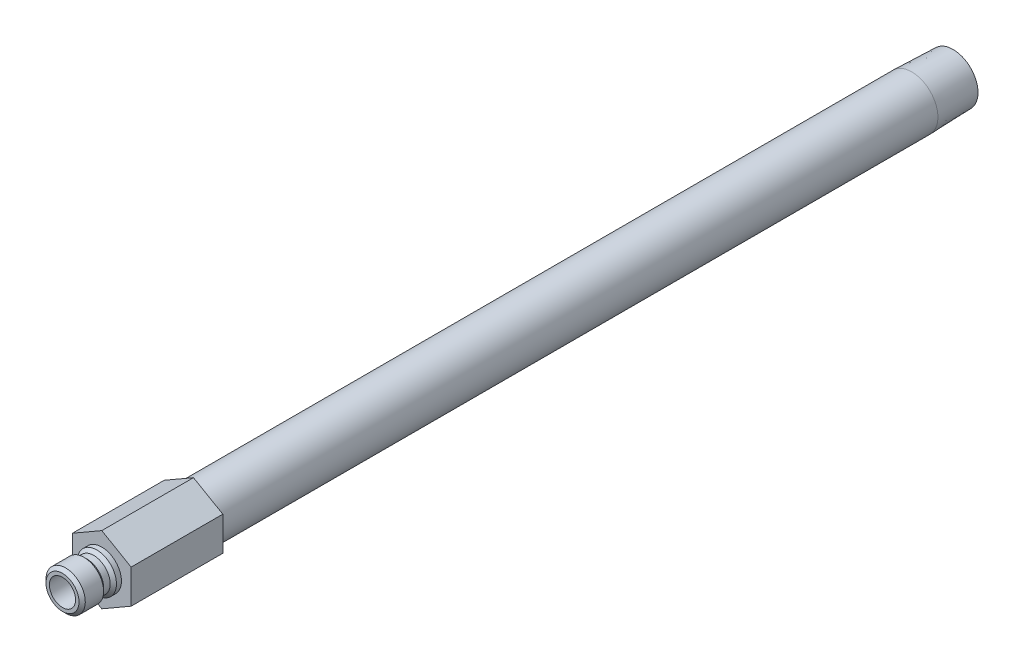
from build123d import *

# Parameters (mm, degrees)
SKETCH2_R           = 3.175
BOSS_EXTRUDE1_DEPTH = 22.225


with BuildPart() as part:
    # Sketch1 → Revolve1 (revolve)
    with BuildSketch(Plane(origin=(0, 0, 0), x_dir=(0, 0, -1), z_dir=(1, 0, 0))):
        Polygon((-9.525, 3.175), (-9.525, 4.0005), (-8.763, 4.7625), (-4.318, 4.7625), (-3.556, 4.0005), (-1.9685, 4.0005), (-1.2065, 4.7625), (0, 4.7625), (0, 6.35), (196.342, 6.35), (206.375, 6.036470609), (206.375, 4.6228), (22.225, 4.6228), (22.225, 3.175), align=None)
    revolve(axis=Axis((0, 0, 0), (0, 0, 1)))

    # Sketch2 → Boss-Extrude1 (add)
    with BuildSketch(Plane.XY):
        Polygon((-7.112, 4.106115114), (-7.112, -4.106115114), (0, -8.212230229), (7.112, -4.106115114), (7.112, 4.106115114), (0, 8.212230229), align=None)
        with Locations(Location((0, 0, 0), (0, 0, 90))):
            Circle(SKETCH2_R, mode=Mode.SUBTRACT)
    extrude(amount=-BOSS_EXTRUDE1_DEPTH)


solid = part.part
